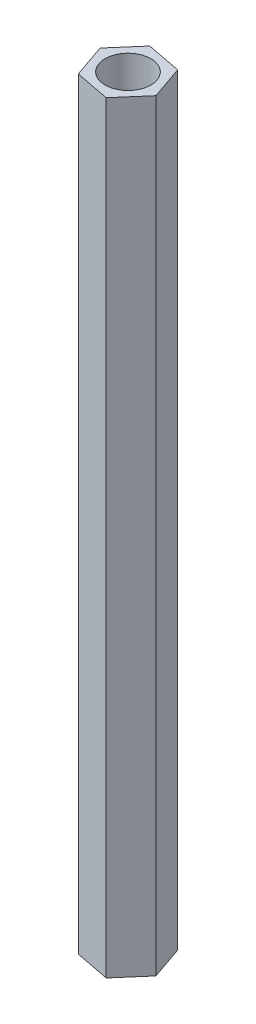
from build123d import *

# Parameters (mm, degrees)
SKETCH1_R           = 1.5
BOSS_EXTRUDE1_DEPTH = 50


with BuildPart() as part:
    # Sketch1 → Boss-Extrude1 (new body)
    with BuildSketch(Plane(origin=(0, 0, 0), x_dir=(1, 0, 0), z_dir=(0, 1, 0))):
        Polygon((0.755024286, -2.182492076), (2.267605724, -0.437375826), (1.512581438, 1.74511625), (-0.755024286, 2.182492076), (-2.267605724, 0.437375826), (-1.512581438, -1.74511625), align=None)
        with Locations(Location((0, 0, 0), (0, 0, 270))):
            Circle(SKETCH1_R, mode=Mode.SUBTRACT)
    extrude(amount=BOSS_EXTRUDE1_DEPTH)


solid = part.part
